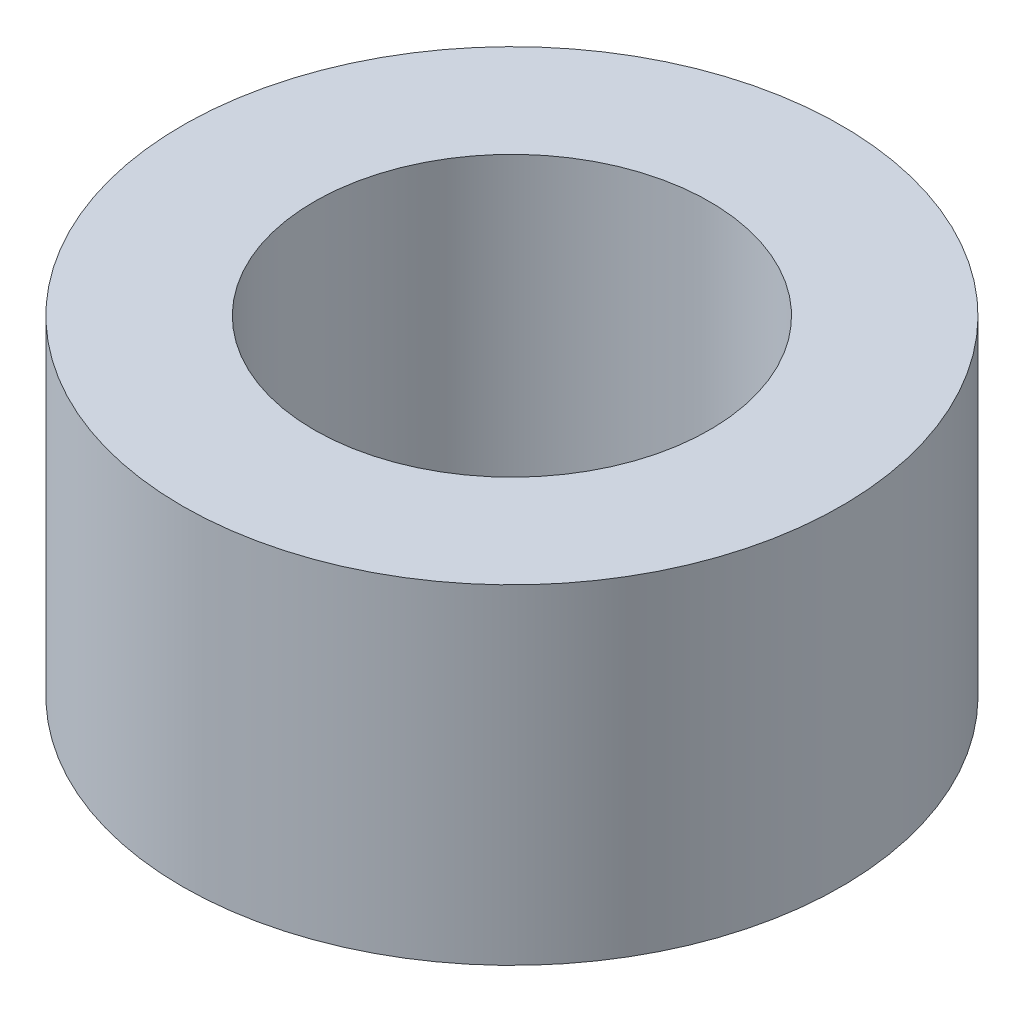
from build123d import *

# Parameters (mm, degrees)
SKETCH1_R      = 6.35
SKETCH1_R_2    = 3.81
EXTRUDE1_DEPTH = 6.35


with BuildPart() as part:
    # Sketch1 → Extrude1 (new body)
    with BuildSketch(Plane(origin=(0, 0, 0), x_dir=(1, 0, 0), z_dir=(0, 1, 0))):
        with Locations(Location((0, 0, 0), (0, 0, 270))):
            Circle(SKETCH1_R)
        with Locations(Location((0, 0, 0), (0, 0, 270))):
            Circle(SKETCH1_R_2, mode=Mode.SUBTRACT)
    extrude(amount=EXTRUDE1_DEPTH)


solid = part.part
